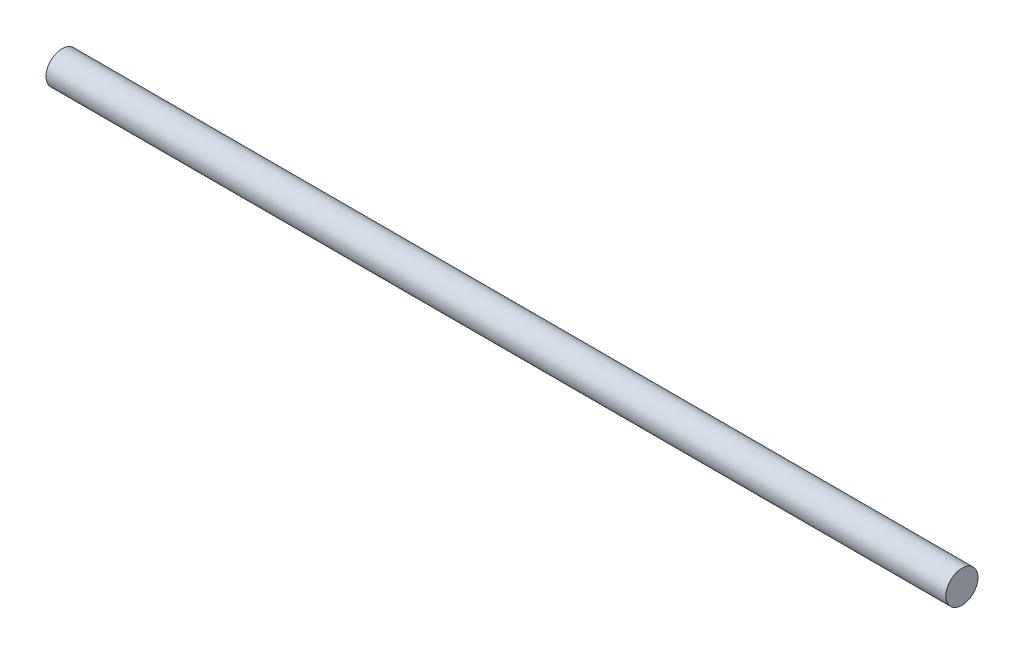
ISO-10303-21;
HEADER;
FILE_DESCRIPTION(('STEP AP214'),'2;1');
FILE_NAME('part.step','',(''),(''),'','','');
FILE_SCHEMA(('AUTOMOTIVE_DESIGN { 1 0 10303 214 1 1 1 1 }'));
ENDSEC;
DATA;
#1=APPLICATION_CONTEXT('core data for automotive mechanical design processes');
#2=APPLICATION_PROTOCOL_DEFINITION('international standard','automotive_design',2000,#1);
#3=PRODUCT_CONTEXT('',#1,'mechanical');
#4=PRODUCT('Part','Part','',(#3));
#5=PRODUCT_RELATED_PRODUCT_CATEGORY('part','',(#4));
#6=PRODUCT_DEFINITION_FORMATION('','',#4);
#7=PRODUCT_DEFINITION_CONTEXT('part definition',#1,'design');
#8=PRODUCT_DEFINITION('design','',#6,#7);
#9=PRODUCT_DEFINITION_SHAPE('','',#8);
#10=(LENGTH_UNIT() NAMED_UNIT(*) SI_UNIT(.MILLI.,.METRE.));
#11=(NAMED_UNIT(*) PLANE_ANGLE_UNIT() SI_UNIT($,.RADIAN.));
#12=(NAMED_UNIT(*) SI_UNIT($,.STERADIAN.) SOLID_ANGLE_UNIT());
#13=UNCERTAINTY_MEASURE_WITH_UNIT(LENGTH_MEASURE(1.E-05),#10,'distance_accuracy_value','');
#14=(GEOMETRIC_REPRESENTATION_CONTEXT(3) GLOBAL_UNCERTAINTY_ASSIGNED_CONTEXT((#13)) GLOBAL_UNIT_ASSIGNED_CONTEXT((#10,
#11,#12)) REPRESENTATION_CONTEXT('',''));
#15=CARTESIAN_POINT('',(0.,0.,0.));
#16=DIRECTION('',(0.,0.,1.));
#17=DIRECTION('',(1.,0.,0.));
#18=AXIS2_PLACEMENT_3D('',#15,#16,#17);
#19=CARTESIAN_POINT('',(-139.3,59.7,0.));
#20=DIRECTION('',(1.,0.,0.));
#21=DIRECTION('',(0.,1.,0.));
#22=AXIS2_PLACEMENT_3D('',#19,#20,#21);
#23=CYLINDRICAL_SURFACE('',#22,2.4875);
#24=CARTESIAN_POINT('',(-139.3,59.7,0.));
#25=DIRECTION('',(-1.,0.,0.));
#26=DIRECTION('',(0.,-1.,0.));
#27=AXIS2_PLACEMENT_3D('',#24,#25,#26);
#28=CIRCLE('',#27,2.4875);
#29=CARTESIAN_POINT('',(-139.3,57.2125,0.));
#30=VERTEX_POINT('',#29);
#31=EDGE_CURVE('E10',#30,#30,#28,.T.);
#32=ORIENTED_EDGE('',*,*,#31,.F.);
#33=EDGE_LOOP('',(#32));
#34=FACE_BOUND('',#33,.T.);
#35=CARTESIAN_POINT('',(0.,59.7,0.));
#36=DIRECTION('',(-1.,0.,0.));
#37=DIRECTION('',(0.,-1.,0.));
#38=AXIS2_PLACEMENT_3D('',#35,#36,#37);
#39=CIRCLE('',#38,2.4875);
#40=CARTESIAN_POINT('',(0.,57.2125,0.));
#41=VERTEX_POINT('',#40);
#42=EDGE_CURVE('E21',#41,#41,#39,.T.);
#43=ORIENTED_EDGE('',*,*,#42,.T.);
#44=EDGE_LOOP('',(#43));
#45=FACE_BOUND('',#44,.T.);
#46=ADVANCED_FACE('F14',(#34,#45),#23,.T.);
#47=CARTESIAN_POINT('',(-139.3,59.7,0.));
#48=DIRECTION('',(-1.,0.,0.));
#49=DIRECTION('',(0.,-1.,0.));
#50=AXIS2_PLACEMENT_3D('',#47,#48,#49);
#51=PLANE('',#50);
#52=ORIENTED_EDGE('',*,*,#31,.T.);
#53=EDGE_LOOP('',(#52));
#54=FACE_BOUND('',#53,.T.);
#55=ADVANCED_FACE('F49',(#54),#51,.T.);
#56=CARTESIAN_POINT('',(0.,59.7,0.));
#57=DIRECTION('',(-1.,0.,0.));
#58=DIRECTION('',(0.,-1.,0.));
#59=AXIS2_PLACEMENT_3D('',#56,#57,#58);
#60=PLANE('',#59);
#61=ORIENTED_EDGE('',*,*,#42,.F.);
#62=EDGE_LOOP('',(#61));
#63=FACE_BOUND('',#62,.T.);
#64=ADVANCED_FACE('F47',(#63),#60,.F.);
#65=CLOSED_SHELL('',(#46,#55,#64));
#66=MANIFOLD_SOLID_BREP('B1',#65);
#67=ADVANCED_BREP_SHAPE_REPRESENTATION('',(#18,#66),#14);
#68=SHAPE_DEFINITION_REPRESENTATION(#9,#67);
ENDSEC;
END-ISO-10303-21;
